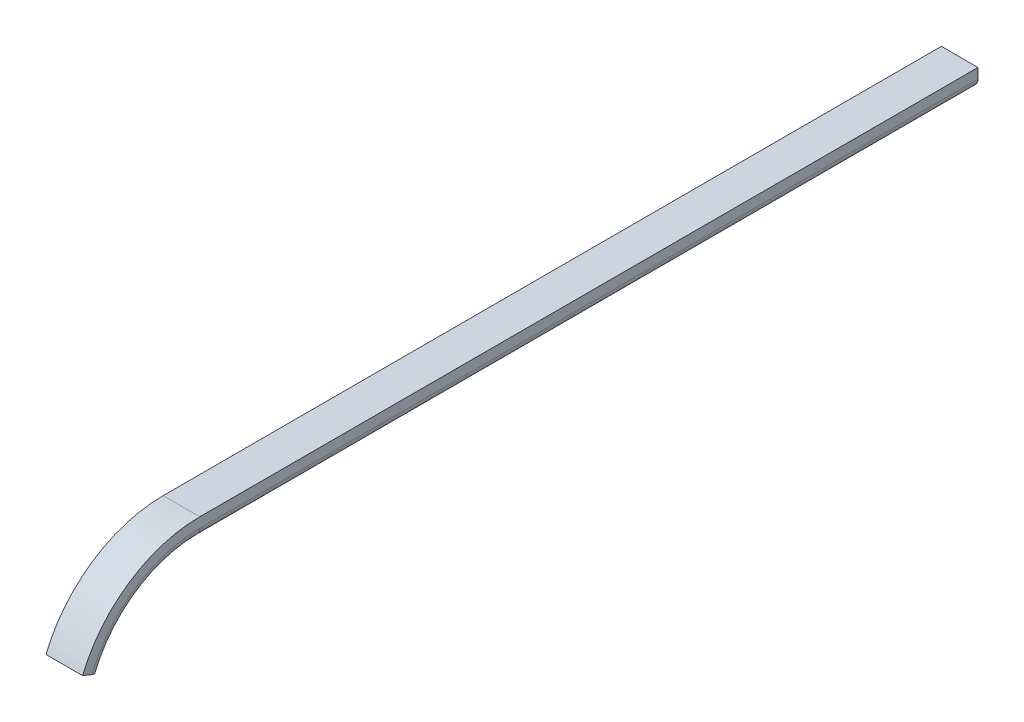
from build123d import *

# Parameters (mm, degrees)
EXTRUSION1_DEPTH  = 425
R_VOLUTION1_ANGLE = 68


with BuildPart() as part:
    # Esquisse1 → Extrusion1 (new body)
    with BuildSketch(Plane.XY):
        with BuildLine():
            Line((0, 0), (20, 0))
            Line((20, 0), (20, -5.5))
            ThreePointArc((20, -5.5), (18.270476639, -9.046048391), (14.41135147, -9.866330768))
            Line((14.41135147, -9.866330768), (8.573886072, -8.410887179))
            Line((8.573886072, -8.410887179), (9.299651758, -5.5))
            Line((9.299651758, -5.5), (15.137117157, -6.955443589))
            ThreePointArc((15.137117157, -6.955443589), (16.423492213, -6.68201613), (17, -5.5))
            Line((17, -5.5), (17, -3))
            Line((17, -3), (0, -3))
            Line((0, -3), (0, 0))
        make_face()
    extrude(amount=EXTRUSION1_DEPTH)

    # Esquisse2 → R_volution1 (revolve)
    with BuildSketch(Plane.XY.offset(425)):
        with BuildLine():
            Line((0, 0), (20, 0))
            Line((20, 0), (20, -5.5))
            ThreePointArc((20, -5.5), (18.270476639, -9.046048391), (14.41135147, -9.866330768))
            Line((14.41135147, -9.866330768), (8.573886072, -8.410887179))
            Line((8.573886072, -8.410887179), (9.299651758, -5.5))
            Line((9.299651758, -5.5), (15.137117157, -6.955443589))
            ThreePointArc((15.137117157, -6.955443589), (16.423492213, -6.68201613), (17, -5.5))
            Line((17, -5.5), (17, -3))
            Line((17, -3), (0, -3))
            Line((0, -3), (0, 0))
        make_face()
    revolve(axis=Axis((-2.536905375, -69, 425), (1, 0, 0)), revolution_arc=R_VOLUTION1_ANGLE)


solid = part.part
